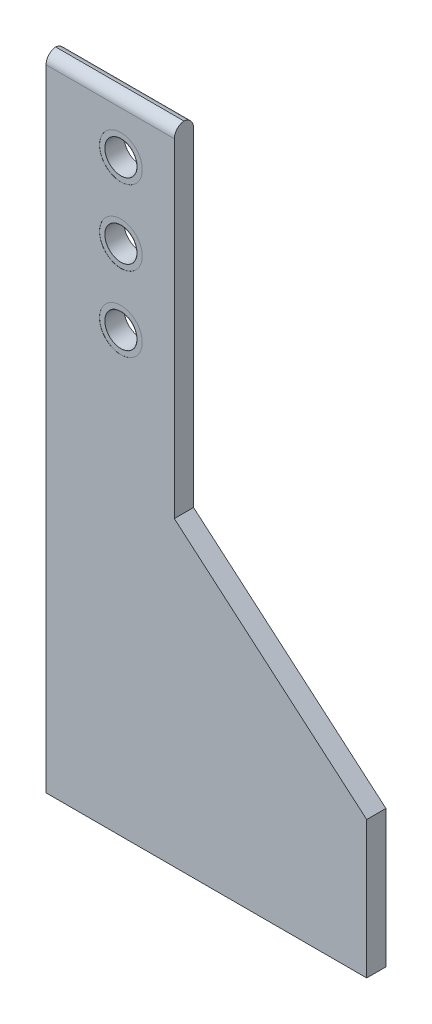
ISO-10303-21;
HEADER;
FILE_DESCRIPTION(('STEP AP214'),'2;1');
FILE_NAME('part.step','',(''),(''),'','','');
FILE_SCHEMA(('AUTOMOTIVE_DESIGN { 1 0 10303 214 1 1 1 1 }'));
ENDSEC;
DATA;
#1=APPLICATION_CONTEXT('core data for automotive mechanical design processes');
#2=APPLICATION_PROTOCOL_DEFINITION('international standard','automotive_design',2000,#1);
#3=PRODUCT_CONTEXT('',#1,'mechanical');
#4=PRODUCT('Part','Part','',(#3));
#5=PRODUCT_RELATED_PRODUCT_CATEGORY('part','',(#4));
#6=PRODUCT_DEFINITION_FORMATION('','',#4);
#7=PRODUCT_DEFINITION_CONTEXT('part definition',#1,'design');
#8=PRODUCT_DEFINITION('design','',#6,#7);
#9=PRODUCT_DEFINITION_SHAPE('','',#8);
#10=(LENGTH_UNIT() NAMED_UNIT(*) SI_UNIT(.MILLI.,.METRE.));
#11=(NAMED_UNIT(*) PLANE_ANGLE_UNIT() SI_UNIT($,.RADIAN.));
#12=(NAMED_UNIT(*) SI_UNIT($,.STERADIAN.) SOLID_ANGLE_UNIT());
#13=UNCERTAINTY_MEASURE_WITH_UNIT(LENGTH_MEASURE(1.E-05),#10,'distance_accuracy_value','');
#14=(GEOMETRIC_REPRESENTATION_CONTEXT(3) GLOBAL_UNCERTAINTY_ASSIGNED_CONTEXT((#13)) GLOBAL_UNIT_ASSIGNED_CONTEXT((#10,
#11,#12)) REPRESENTATION_CONTEXT('',''));
#15=CARTESIAN_POINT('',(0.,0.,0.));
#16=DIRECTION('',(0.,0.,1.));
#17=DIRECTION('',(1.,0.,0.));
#18=AXIS2_PLACEMENT_3D('',#15,#16,#17);
#19=CARTESIAN_POINT('',(0.,0.,0.));
#20=DIRECTION('',(0.,0.,1.));
#21=DIRECTION('',(1.,0.,0.));
#22=AXIS2_PLACEMENT_3D('',#19,#20,#21);
#23=PLANE('',#22);
#24=DIRECTION('',(0.,-1.,0.));
#25=VECTOR('',#24,1.);
#26=CARTESIAN_POINT('',(-150.,300.,0.));
#27=LINE('',#26,#25);
#28=CARTESIAN_POINT('',(-150.,290.,0.));
#29=VERTEX_POINT('',#28);
#30=CARTESIAN_POINT('',(-150.,-300.,0.));
#31=VERTEX_POINT('',#30);
#32=EDGE_CURVE('E139',#29,#31,#27,.T.);
#33=ORIENTED_EDGE('',*,*,#32,.F.);
#34=DIRECTION('',(-1.,0.,0.));
#35=VECTOR('',#34,1.);
#36=CARTESIAN_POINT('',(0.,290.,0.));
#37=LINE('',#36,#35);
#38=CARTESIAN_POINT('',(-30.,290.,0.));
#39=VERTEX_POINT('',#38);
#40=EDGE_CURVE('E154',#29,#39,#37,.F.);
#41=ORIENTED_EDGE('',*,*,#40,.T.);
#42=DIRECTION('',(0.,-1.,0.));
#43=VECTOR('',#42,1.);
#44=CARTESIAN_POINT('',(-30.,0.,0.));
#45=LINE('',#44,#43);
#46=CARTESIAN_POINT('',(-30.,-17.7530546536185,0.));
#47=VERTEX_POINT('',#46);
#48=EDGE_CURVE('E148',#39,#47,#45,.T.);
#49=ORIENTED_EDGE('',*,*,#48,.T.);
#50=DIRECTION('',(0.760181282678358,-0.649711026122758,0.));
#51=VECTOR('',#50,1.);
#52=CARTESIAN_POINT('',(-21.4319335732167,-25.076001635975,0.));
#53=LINE('',#52,#51);
#54=CARTESIAN_POINT('',(150.,-171.595285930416,0.));
#55=VERTEX_POINT('',#54);
#56=EDGE_CURVE('E100',#47,#55,#53,.T.);
#57=ORIENTED_EDGE('',*,*,#56,.T.);
#58=DIRECTION('',(0.,1.,0.));
#59=VECTOR('',#58,1.);
#60=CARTESIAN_POINT('',(150.,300.,0.));
#61=LINE('',#60,#59);
#62=CARTESIAN_POINT('',(150.,-300.,0.));
#63=VERTEX_POINT('',#62);
#64=EDGE_CURVE('E127',#63,#55,#61,.T.);
#65=ORIENTED_EDGE('',*,*,#64,.F.);
#66=DIRECTION('',(1.,0.,0.));
#67=VECTOR('',#66,1.);
#68=CARTESIAN_POINT('',(-150.,-300.,0.));
#69=LINE('',#68,#67);
#70=EDGE_CURVE('E132',#31,#63,#69,.T.);
#71=ORIENTED_EDGE('',*,*,#70,.F.);
#72=EDGE_LOOP('',(#33,#41,#49,#57,#65,#71));
#73=FACE_BOUND('',#72,.T.);
#74=CARTESIAN_POINT('',(-80.,250.,0.));
#75=DIRECTION('',(0.,0.,1.));
#76=DIRECTION('',(1.,0.,0.));
#77=AXIS2_PLACEMENT_3D('',#74,#75,#76);
#78=CIRCLE('',#77,20.);
#79=CARTESIAN_POINT('',(-60.,250.,0.));
#80=VERTEX_POINT('',#79);
#81=EDGE_CURVE('E209',#80,#80,#78,.T.);
#82=ORIENTED_EDGE('',*,*,#81,.T.);
#83=EDGE_LOOP('',(#82));
#84=FACE_BOUND('',#83,.T.);
#85=CARTESIAN_POINT('',(-80.,180.,0.));
#86=DIRECTION('',(0.,0.,1.));
#87=DIRECTION('',(1.,0.,0.));
#88=AXIS2_PLACEMENT_3D('',#85,#86,#87);
#89=CIRCLE('',#88,20.);
#90=CARTESIAN_POINT('',(-60.,180.,0.));
#91=VERTEX_POINT('',#90);
#92=EDGE_CURVE('E221',#91,#91,#89,.T.);
#93=ORIENTED_EDGE('',*,*,#92,.T.);
#94=EDGE_LOOP('',(#93));
#95=FACE_BOUND('',#94,.T.);
#96=CARTESIAN_POINT('',(-80.,110.,0.));
#97=DIRECTION('',(0.,0.,1.));
#98=DIRECTION('',(1.,0.,0.));
#99=AXIS2_PLACEMENT_3D('',#96,#97,#98);
#100=CIRCLE('',#99,20.);
#101=CARTESIAN_POINT('',(-60.,110.,0.));
#102=VERTEX_POINT('',#101);
#103=EDGE_CURVE('E233',#102,#102,#100,.T.);
#104=ORIENTED_EDGE('',*,*,#103,.T.);
#105=EDGE_LOOP('',(#104));
#106=FACE_BOUND('',#105,.T.);
#107=ADVANCED_FACE('F32',(#73,#84,#95,#106),#23,.F.);
#108=CARTESIAN_POINT('',(-80.,110.,0.));
#109=DIRECTION('',(0.,0.,1.));
#110=DIRECTION('',(1.,0.,0.));
#111=AXIS2_PLACEMENT_3D('',#108,#109,#110);
#112=CIRCLE('',#111,15.1);
#113=CARTESIAN_POINT('',(-64.9,110.,0.));
#114=VERTEX_POINT('',#113);
#115=EDGE_CURVE('E239',#114,#114,#112,.T.);
#116=ORIENTED_EDGE('',*,*,#115,.F.);
#117=EDGE_LOOP('',(#116));
#118=FACE_BOUND('',#117,.T.);
#119=CARTESIAN_POINT('',(-80.,110.,0.));
#120=DIRECTION('',(0.,0.,1.));
#121=DIRECTION('',(1.,0.,0.));
#122=AXIS2_PLACEMENT_3D('',#119,#120,#121);
#123=CIRCLE('',#122,15.);
#124=CARTESIAN_POINT('',(-65.,110.,0.));
#125=VERTEX_POINT('',#124);
#126=EDGE_CURVE('E112',#125,#125,#123,.T.);
#127=ORIENTED_EDGE('',*,*,#126,.T.);
#128=EDGE_LOOP('',(#127));
#129=FACE_BOUND('',#128,.T.);
#130=ADVANCED_FACE('F254',(#118,#129),#23,.F.);
#131=CARTESIAN_POINT('',(-80.,180.,0.));
#132=DIRECTION('',(0.,0.,1.));
#133=DIRECTION('',(1.,0.,0.));
#134=AXIS2_PLACEMENT_3D('',#131,#132,#133);
#135=CIRCLE('',#134,15.1);
#136=CARTESIAN_POINT('',(-64.9,180.,0.));
#137=VERTEX_POINT('',#136);
#138=EDGE_CURVE('E227',#137,#137,#135,.T.);
#139=ORIENTED_EDGE('',*,*,#138,.F.);
#140=EDGE_LOOP('',(#139));
#141=FACE_BOUND('',#140,.T.);
#142=CARTESIAN_POINT('',(-80.,180.,0.));
#143=DIRECTION('',(0.,0.,1.));
#144=DIRECTION('',(1.,0.,0.));
#145=AXIS2_PLACEMENT_3D('',#142,#143,#144);
#146=CIRCLE('',#145,15.);
#147=CARTESIAN_POINT('',(-65.,180.,0.));
#148=VERTEX_POINT('',#147);
#149=EDGE_CURVE('E118',#148,#148,#146,.T.);
#150=ORIENTED_EDGE('',*,*,#149,.T.);
#151=EDGE_LOOP('',(#150));
#152=FACE_BOUND('',#151,.T.);
#153=ADVANCED_FACE('F257',(#141,#152),#23,.F.);
#154=CARTESIAN_POINT('',(0.,0.,18.));
#155=DIRECTION('',(0.,0.,1.));
#156=DIRECTION('',(1.,0.,0.));
#157=AXIS2_PLACEMENT_3D('',#154,#155,#156);
#158=PLANE('',#157);
#159=CARTESIAN_POINT('',(-80.,110.,18.));
#160=DIRECTION('',(0.,0.,1.));
#161=DIRECTION('',(1.,0.,0.));
#162=AXIS2_PLACEMENT_3D('',#159,#160,#161);
#163=CIRCLE('',#162,15.);
#164=CARTESIAN_POINT('',(-65.,110.,18.));
#165=VERTEX_POINT('',#164);
#166=EDGE_CURVE('E110',#165,#165,#163,.T.);
#167=ORIENTED_EDGE('',*,*,#166,.F.);
#168=EDGE_LOOP('',(#167));
#169=FACE_BOUND('',#168,.T.);
#170=CARTESIAN_POINT('',(-80.,110.,18.));
#171=DIRECTION('',(0.,0.,1.));
#172=DIRECTION('',(1.,0.,0.));
#173=AXIS2_PLACEMENT_3D('',#170,#171,#172);
#174=CIRCLE('',#173,15.1);
#175=CARTESIAN_POINT('',(-64.9,110.,18.));
#176=VERTEX_POINT('',#175);
#177=EDGE_CURVE('E203',#176,#176,#174,.T.);
#178=ORIENTED_EDGE('',*,*,#177,.T.);
#179=EDGE_LOOP('',(#178));
#180=FACE_BOUND('',#179,.T.);
#181=ADVANCED_FACE('F268',(#169,#180),#158,.T.);
#182=CARTESIAN_POINT('',(-80.,180.,18.));
#183=DIRECTION('',(0.,0.,1.));
#184=DIRECTION('',(1.,0.,0.));
#185=AXIS2_PLACEMENT_3D('',#182,#183,#184);
#186=CIRCLE('',#185,15.);
#187=CARTESIAN_POINT('',(-65.,180.,18.));
#188=VERTEX_POINT('',#187);
#189=EDGE_CURVE('E115',#188,#188,#186,.T.);
#190=ORIENTED_EDGE('',*,*,#189,.F.);
#191=EDGE_LOOP('',(#190));
#192=FACE_BOUND('',#191,.T.);
#193=CARTESIAN_POINT('',(-80.,180.,18.));
#194=DIRECTION('',(0.,0.,1.));
#195=DIRECTION('',(1.,0.,0.));
#196=AXIS2_PLACEMENT_3D('',#193,#194,#195);
#197=CIRCLE('',#196,15.1);
#198=CARTESIAN_POINT('',(-64.9,180.,18.));
#199=VERTEX_POINT('',#198);
#200=EDGE_CURVE('E191',#199,#199,#197,.T.);
#201=ORIENTED_EDGE('',*,*,#200,.T.);
#202=EDGE_LOOP('',(#201));
#203=FACE_BOUND('',#202,.T.);
#204=ADVANCED_FACE('F271',(#192,#203),#158,.T.);
#205=CARTESIAN_POINT('',(-80.,250.,18.));
#206=DIRECTION('',(0.,0.,1.));
#207=DIRECTION('',(1.,0.,0.));
#208=AXIS2_PLACEMENT_3D('',#205,#206,#207);
#209=CIRCLE('',#208,15.);
#210=CARTESIAN_POINT('',(-65.,250.,18.));
#211=VERTEX_POINT('',#210);
#212=EDGE_CURVE('E121',#211,#211,#209,.T.);
#213=ORIENTED_EDGE('',*,*,#212,.F.);
#214=EDGE_LOOP('',(#213));
#215=FACE_BOUND('',#214,.T.);
#216=CARTESIAN_POINT('',(-80.,250.,18.));
#217=DIRECTION('',(0.,0.,1.));
#218=DIRECTION('',(1.,0.,0.));
#219=AXIS2_PLACEMENT_3D('',#216,#217,#218);
#220=CIRCLE('',#219,15.1);
#221=CARTESIAN_POINT('',(-64.9,250.,18.));
#222=VERTEX_POINT('',#221);
#223=EDGE_CURVE('E179',#222,#222,#220,.T.);
#224=ORIENTED_EDGE('',*,*,#223,.T.);
#225=EDGE_LOOP('',(#224));
#226=FACE_BOUND('',#225,.T.);
#227=ADVANCED_FACE('F308',(#215,#226),#158,.T.);
#228=CARTESIAN_POINT('',(150.,300.,18.));
#229=DIRECTION('',(-1.,0.,0.));
#230=DIRECTION('',(0.,0.,1.));
#231=AXIS2_PLACEMENT_3D('',#228,#229,#230);
#232=PLANE('',#231);
#233=ORIENTED_EDGE('',*,*,#64,.T.);
#234=DIRECTION('',(0.,0.,1.));
#235=VECTOR('',#234,1.);
#236=CARTESIAN_POINT('',(150.,-171.595285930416,-42.));
#237=LINE('',#236,#235);
#238=CARTESIAN_POINT('',(150.,-171.595285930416,18.));
#239=VERTEX_POINT('',#238);
#240=EDGE_CURVE('E101',#55,#239,#237,.T.);
#241=ORIENTED_EDGE('',*,*,#240,.T.);
#242=DIRECTION('',(0.,1.,0.));
#243=VECTOR('',#242,1.);
#244=CARTESIAN_POINT('',(150.,300.,18.));
#245=LINE('',#244,#243);
#246=CARTESIAN_POINT('',(150.,-300.,18.));
#247=VERTEX_POINT('',#246);
#248=EDGE_CURVE('E106',#247,#239,#245,.T.);
#249=ORIENTED_EDGE('',*,*,#248,.F.);
#250=DIRECTION('',(0.,0.,-1.));
#251=VECTOR('',#250,1.);
#252=CARTESIAN_POINT('',(150.,-300.,18.));
#253=LINE('',#252,#251);
#254=EDGE_CURVE('E136',#247,#63,#253,.T.);
#255=ORIENTED_EDGE('',*,*,#254,.T.);
#256=EDGE_LOOP('',(#233,#241,#249,#255));
#257=FACE_BOUND('',#256,.T.);
#258=ADVANCED_FACE('F573',(#257),#232,.F.);
#259=CARTESIAN_POINT('',(-150.,300.,18.));
#260=DIRECTION('',(1.,0.,0.));
#261=DIRECTION('',(0.,1.,0.));
#262=AXIS2_PLACEMENT_3D('',#259,#260,#261);
#263=PLANE('',#262);
#264=CARTESIAN_POINT('',(-150.,290.,8.));
#265=DIRECTION('',(1.,0.,0.));
#266=DIRECTION('',(0.,1.,0.));
#267=AXIS2_PLACEMENT_3D('',#264,#265,#266);
#268=CIRCLE('',#267,10.);
#269=CARTESIAN_POINT('',(-150.,290.,18.));
#270=VERTEX_POINT('',#269);
#271=CARTESIAN_POINT('',(-150.,299.949874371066,9.));
#272=VERTEX_POINT('',#271);
#273=EDGE_CURVE('E150',#270,#272,#268,.F.);
#274=ORIENTED_EDGE('',*,*,#273,.T.);
#275=CARTESIAN_POINT('',(-150.,290.,10.));
#276=DIRECTION('',(1.,0.,0.));
#277=DIRECTION('',(0.,1.,0.));
#278=AXIS2_PLACEMENT_3D('',#275,#276,#277);
#279=CIRCLE('',#278,10.);
#280=EDGE_CURVE('E152',#272,#29,#279,.F.);
#281=ORIENTED_EDGE('',*,*,#280,.T.);
#282=ORIENTED_EDGE('',*,*,#32,.T.);
#283=DIRECTION('',(0.,0.,-1.));
#284=VECTOR('',#283,1.);
#285=CARTESIAN_POINT('',(-150.,-300.,18.));
#286=LINE('',#285,#284);
#287=CARTESIAN_POINT('',(-150.,-300.,18.));
#288=VERTEX_POINT('',#287);
#289=EDGE_CURVE('E144',#288,#31,#286,.T.);
#290=ORIENTED_EDGE('',*,*,#289,.F.);
#291=DIRECTION('',(0.,-1.,0.));
#292=VECTOR('',#291,1.);
#293=CARTESIAN_POINT('',(-150.,300.,18.));
#294=LINE('',#293,#292);
#295=EDGE_CURVE('E131',#270,#288,#294,.T.);
#296=ORIENTED_EDGE('',*,*,#295,.F.);
#297=EDGE_LOOP('',(#274,#281,#282,#290,#296));
#298=FACE_BOUND('',#297,.T.);
#299=ADVANCED_FACE('F598',(#298),#263,.F.);
#300=CARTESIAN_POINT('',(-150.,-300.,18.));
#301=DIRECTION('',(0.,1.,0.));
#302=DIRECTION('',(0.,0.,1.));
#303=AXIS2_PLACEMENT_3D('',#300,#301,#302);
#304=PLANE('',#303);
#305=ORIENTED_EDGE('',*,*,#70,.T.);
#306=ORIENTED_EDGE('',*,*,#254,.F.);
#307=DIRECTION('',(1.,0.,0.));
#308=VECTOR('',#307,1.);
#309=CARTESIAN_POINT('',(-150.,-300.,18.));
#310=LINE('',#309,#308);
#311=EDGE_CURVE('E134',#288,#247,#310,.T.);
#312=ORIENTED_EDGE('',*,*,#311,.F.);
#313=ORIENTED_EDGE('',*,*,#289,.T.);
#314=EDGE_LOOP('',(#305,#306,#312,#313));
#315=FACE_BOUND('',#314,.T.);
#316=ADVANCED_FACE('F306',(#315),#304,.F.);
#317=CARTESIAN_POINT('',(-80.,110.,18.));
#318=DIRECTION('',(0.,0.,1.));
#319=DIRECTION('',(1.,0.,0.));
#320=AXIS2_PLACEMENT_3D('',#317,#318,#319);
#321=CIRCLE('',#320,20.);
#322=CARTESIAN_POINT('',(-60.,110.,18.));
#323=VERTEX_POINT('',#322);
#324=EDGE_CURVE('E197',#323,#323,#321,.T.);
#325=ORIENTED_EDGE('',*,*,#324,.F.);
#326=EDGE_LOOP('',(#325));
#327=FACE_BOUND('',#326,.T.);
#328=CARTESIAN_POINT('',(-80.,180.,18.));
#329=DIRECTION('',(0.,0.,1.));
#330=DIRECTION('',(1.,0.,0.));
#331=AXIS2_PLACEMENT_3D('',#328,#329,#330);
#332=CIRCLE('',#331,20.);
#333=CARTESIAN_POINT('',(-60.,180.,18.));
#334=VERTEX_POINT('',#333);
#335=EDGE_CURVE('E185',#334,#334,#332,.T.);
#336=ORIENTED_EDGE('',*,*,#335,.F.);
#337=EDGE_LOOP('',(#336));
#338=FACE_BOUND('',#337,.T.);
#339=CARTESIAN_POINT('',(-80.,250.,18.));
#340=DIRECTION('',(0.,0.,1.));
#341=DIRECTION('',(1.,0.,0.));
#342=AXIS2_PLACEMENT_3D('',#339,#340,#341);
#343=CIRCLE('',#342,20.);
#344=CARTESIAN_POINT('',(-60.,250.,18.));
#345=VERTEX_POINT('',#344);
#346=EDGE_CURVE('E172',#345,#345,#343,.T.);
#347=ORIENTED_EDGE('',*,*,#346,.F.);
#348=EDGE_LOOP('',(#347));
#349=FACE_BOUND('',#348,.T.);
#350=DIRECTION('',(0.,-1.,0.));
#351=VECTOR('',#350,1.);
#352=CARTESIAN_POINT('',(-30.,300.,18.));
#353=LINE('',#352,#351);
#354=CARTESIAN_POINT('',(-30.,290.,18.));
#355=VERTEX_POINT('',#354);
#356=CARTESIAN_POINT('',(-30.,-17.7530546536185,18.));
#357=VERTEX_POINT('',#356);
#358=EDGE_CURVE('E86',#355,#357,#353,.T.);
#359=ORIENTED_EDGE('',*,*,#358,.F.);
#360=DIRECTION('',(-1.,0.,0.));
#361=VECTOR('',#360,1.);
#362=CARTESIAN_POINT('',(-150.,290.,18.));
#363=LINE('',#362,#361);
#364=EDGE_CURVE('E11',#355,#270,#363,.T.);
#365=ORIENTED_EDGE('',*,*,#364,.T.);
#366=ORIENTED_EDGE('',*,*,#295,.T.);
#367=ORIENTED_EDGE('',*,*,#311,.T.);
#368=ORIENTED_EDGE('',*,*,#248,.T.);
#369=DIRECTION('',(0.760181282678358,-0.649711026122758,0.));
#370=VECTOR('',#369,1.);
#371=CARTESIAN_POINT('',(-30.,-17.7530546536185,18.));
#372=LINE('',#371,#370);
#373=EDGE_CURVE('E93',#357,#239,#372,.T.);
#374=ORIENTED_EDGE('',*,*,#373,.F.);
#375=EDGE_LOOP('',(#359,#365,#366,#367,#368,#374));
#376=FACE_BOUND('',#375,.T.);
#377=ADVANCED_FACE('F104',(#327,#338,#349,#376),#158,.T.);
#378=CARTESIAN_POINT('',(-80.,250.,0.));
#379=DIRECTION('',(0.,0.,1.));
#380=DIRECTION('',(1.,0.,0.));
#381=AXIS2_PLACEMENT_3D('',#378,#379,#380);
#382=CIRCLE('',#381,15.1);
#383=CARTESIAN_POINT('',(-64.9,250.,0.));
#384=VERTEX_POINT('',#383);
#385=EDGE_CURVE('E215',#384,#384,#382,.T.);
#386=ORIENTED_EDGE('',*,*,#385,.F.);
#387=EDGE_LOOP('',(#386));
#388=FACE_BOUND('',#387,.T.);
#389=CARTESIAN_POINT('',(-80.,250.,0.));
#390=DIRECTION('',(0.,0.,1.));
#391=DIRECTION('',(1.,0.,0.));
#392=AXIS2_PLACEMENT_3D('',#389,#390,#391);
#393=CIRCLE('',#392,15.);
#394=CARTESIAN_POINT('',(-65.,250.,0.));
#395=VERTEX_POINT('',#394);
#396=EDGE_CURVE('E124',#395,#395,#393,.T.);
#397=ORIENTED_EDGE('',*,*,#396,.T.);
#398=EDGE_LOOP('',(#397));
#399=FACE_BOUND('',#398,.T.);
#400=ADVANCED_FACE('F293',(#388,#399),#23,.F.);
#401=CARTESIAN_POINT('',(-80.,250.,0.));
#402=DIRECTION('',(0.,0.,1.));
#403=DIRECTION('',(1.,0.,0.));
#404=AXIS2_PLACEMENT_3D('',#401,#402,#403);
#405=CYLINDRICAL_SURFACE('',#404,15.);
#406=ORIENTED_EDGE('',*,*,#396,.F.);
#407=EDGE_LOOP('',(#406));
#408=FACE_BOUND('',#407,.T.);
#409=ORIENTED_EDGE('',*,*,#212,.T.);
#410=EDGE_LOOP('',(#409));
#411=FACE_BOUND('',#410,.T.);
#412=ADVANCED_FACE('F298',(#408,#411),#405,.F.);
#413=CARTESIAN_POINT('',(-80.,180.,0.));
#414=DIRECTION('',(0.,0.,1.));
#415=DIRECTION('',(1.,0.,0.));
#416=AXIS2_PLACEMENT_3D('',#413,#414,#415);
#417=CYLINDRICAL_SURFACE('',#416,15.);
#418=ORIENTED_EDGE('',*,*,#149,.F.);
#419=EDGE_LOOP('',(#418));
#420=FACE_BOUND('',#419,.T.);
#421=ORIENTED_EDGE('',*,*,#189,.T.);
#422=EDGE_LOOP('',(#421));
#423=FACE_BOUND('',#422,.T.);
#424=ADVANCED_FACE('F264',(#420,#423),#417,.F.);
#425=CARTESIAN_POINT('',(-80.,110.,0.));
#426=DIRECTION('',(0.,0.,1.));
#427=DIRECTION('',(1.,0.,0.));
#428=AXIS2_PLACEMENT_3D('',#425,#426,#427);
#429=CYLINDRICAL_SURFACE('',#428,15.);
#430=ORIENTED_EDGE('',*,*,#126,.F.);
#431=EDGE_LOOP('',(#430));
#432=FACE_BOUND('',#431,.T.);
#433=ORIENTED_EDGE('',*,*,#166,.T.);
#434=EDGE_LOOP('',(#433));
#435=FACE_BOUND('',#434,.T.);
#436=ADVANCED_FACE('F261',(#432,#435),#429,.F.);
#437=CARTESIAN_POINT('',(-30.,300.,-42.));
#438=DIRECTION('',(-1.,0.,0.));
#439=DIRECTION('',(0.,-1.,0.));
#440=AXIS2_PLACEMENT_3D('',#437,#438,#439);
#441=PLANE('',#440);
#442=ORIENTED_EDGE('',*,*,#48,.F.);
#443=CARTESIAN_POINT('',(-30.,290.,10.));
#444=DIRECTION('',(-1.,0.,0.));
#445=DIRECTION('',(0.,-1.,0.));
#446=AXIS2_PLACEMENT_3D('',#443,#444,#445);
#447=CIRCLE('',#446,10.);
#448=CARTESIAN_POINT('',(-30.,299.949874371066,9.));
#449=VERTEX_POINT('',#448);
#450=EDGE_CURVE('E41',#39,#449,#447,.F.);
#451=ORIENTED_EDGE('',*,*,#450,.T.);
#452=CARTESIAN_POINT('',(-30.,290.,8.));
#453=DIRECTION('',(-1.,0.,0.));
#454=DIRECTION('',(0.,-1.,0.));
#455=AXIS2_PLACEMENT_3D('',#452,#453,#454);
#456=CIRCLE('',#455,10.);
#457=EDGE_CURVE('E51',#449,#355,#456,.F.);
#458=ORIENTED_EDGE('',*,*,#457,.T.);
#459=ORIENTED_EDGE('',*,*,#358,.T.);
#460=DIRECTION('',(0.,0.,1.));
#461=VECTOR('',#460,1.);
#462=CARTESIAN_POINT('',(-30.,-17.7530546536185,-42.));
#463=LINE('',#462,#461);
#464=EDGE_CURVE('E89',#47,#357,#463,.T.);
#465=ORIENTED_EDGE('',*,*,#464,.F.);
#466=EDGE_LOOP('',(#442,#451,#458,#459,#465));
#467=FACE_BOUND('',#466,.T.);
#468=ADVANCED_FACE('F88',(#467),#441,.F.);
#469=CARTESIAN_POINT('',(-30.,-17.7530546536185,-42.));
#470=DIRECTION('',(-0.649711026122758,-0.760181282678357,0.));
#471=DIRECTION('',(0.760181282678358,-0.649711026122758,0.));
#472=AXIS2_PLACEMENT_3D('',#469,#470,#471);
#473=PLANE('',#472);
#474=ORIENTED_EDGE('',*,*,#464,.T.);
#475=ORIENTED_EDGE('',*,*,#373,.T.);
#476=ORIENTED_EDGE('',*,*,#240,.F.);
#477=ORIENTED_EDGE('',*,*,#56,.F.);
#478=EDGE_LOOP('',(#474,#475,#476,#477));
#479=FACE_BOUND('',#478,.T.);
#480=ADVANCED_FACE('F97',(#479),#473,.F.);
#481=CARTESIAN_POINT('',(0.,290.,8.));
#482=DIRECTION('',(1.,0.,0.));
#483=DIRECTION('',(0.,0.,-1.));
#484=AXIS2_PLACEMENT_3D('',#481,#482,#483);
#485=CYLINDRICAL_SURFACE('',#484,10.);
#486=ORIENTED_EDGE('',*,*,#364,.F.);
#487=ORIENTED_EDGE('',*,*,#457,.F.);
#488=DIRECTION('',(1.,0.,0.));
#489=VECTOR('',#488,1.);
#490=CARTESIAN_POINT('',(-90.,299.949874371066,9.));
#491=LINE('',#490,#489);
#492=EDGE_CURVE('E36',#272,#449,#491,.T.);
#493=ORIENTED_EDGE('',*,*,#492,.F.);
#494=ORIENTED_EDGE('',*,*,#273,.F.);
#495=EDGE_LOOP('',(#486,#487,#493,#494));
#496=FACE_BOUND('',#495,.T.);
#497=ADVANCED_FACE('F34',(#496),#485,.T.);
#498=CARTESIAN_POINT('',(-150.,290.,10.));
#499=DIRECTION('',(-1.,0.,0.));
#500=DIRECTION('',(0.,0.,1.));
#501=AXIS2_PLACEMENT_3D('',#498,#499,#500);
#502=CYLINDRICAL_SURFACE('',#501,10.);
#503=ORIENTED_EDGE('',*,*,#450,.F.);
#504=ORIENTED_EDGE('',*,*,#40,.F.);
#505=ORIENTED_EDGE('',*,*,#280,.F.);
#506=ORIENTED_EDGE('',*,*,#492,.T.);
#507=EDGE_LOOP('',(#503,#504,#505,#506));
#508=FACE_BOUND('',#507,.T.);
#509=ADVANCED_FACE('F165',(#508),#502,.T.);
#510=CARTESIAN_POINT('',(-80.,250.,17.9));
#511=DIRECTION('',(0.,0.,1.));
#512=DIRECTION('',(1.,0.,0.));
#513=AXIS2_PLACEMENT_3D('',#510,#511,#512);
#514=CYLINDRICAL_SURFACE('',#513,20.);
#515=CARTESIAN_POINT('',(-80.,250.,17.9));
#516=DIRECTION('',(0.,0.,1.));
#517=DIRECTION('',(1.,0.,0.));
#518=AXIS2_PLACEMENT_3D('',#515,#516,#517);
#519=CIRCLE('',#518,20.);
#520=CARTESIAN_POINT('',(-60.,250.,17.9));
#521=VERTEX_POINT('',#520);
#522=EDGE_CURVE('E170',#521,#521,#519,.T.);
#523=ORIENTED_EDGE('',*,*,#522,.F.);
#524=EDGE_LOOP('',(#523));
#525=FACE_BOUND('',#524,.T.);
#526=ORIENTED_EDGE('',*,*,#346,.T.);
#527=EDGE_LOOP('',(#526));
#528=FACE_BOUND('',#527,.T.);
#529=ADVANCED_FACE('F353',(#525,#528),#514,.F.);
#530=CARTESIAN_POINT('',(-80.,250.,17.9));
#531=DIRECTION('',(0.,0.,1.));
#532=DIRECTION('',(1.,0.,0.));
#533=AXIS2_PLACEMENT_3D('',#530,#531,#532);
#534=PLANE('',#533);
#535=CARTESIAN_POINT('',(-80.,250.,17.9));
#536=DIRECTION('',(0.,0.,1.));
#537=DIRECTION('',(1.,0.,0.));
#538=AXIS2_PLACEMENT_3D('',#535,#536,#537);
#539=CIRCLE('',#538,15.1);
#540=CARTESIAN_POINT('',(-64.9,250.,17.9));
#541=VERTEX_POINT('',#540);
#542=EDGE_CURVE('E177',#541,#541,#539,.T.);
#543=ORIENTED_EDGE('',*,*,#542,.F.);
#544=EDGE_LOOP('',(#543));
#545=FACE_BOUND('',#544,.T.);
#546=ORIENTED_EDGE('',*,*,#522,.T.);
#547=EDGE_LOOP('',(#546));
#548=FACE_BOUND('',#547,.T.);
#549=ADVANCED_FACE('F349',(#545,#548),#534,.T.);
#550=CARTESIAN_POINT('',(-80.,250.,17.9));
#551=DIRECTION('',(0.,0.,1.));
#552=DIRECTION('',(1.,0.,0.));
#553=AXIS2_PLACEMENT_3D('',#550,#551,#552);
#554=CYLINDRICAL_SURFACE('',#553,15.1);
#555=ORIENTED_EDGE('',*,*,#542,.T.);
#556=EDGE_LOOP('',(#555));
#557=FACE_BOUND('',#556,.T.);
#558=ORIENTED_EDGE('',*,*,#223,.F.);
#559=EDGE_LOOP('',(#558));
#560=FACE_BOUND('',#559,.T.);
#561=ADVANCED_FACE('F345',(#557,#560),#554,.T.);
#562=CARTESIAN_POINT('',(-80.,180.,17.9));
#563=DIRECTION('',(0.,0.,1.));
#564=DIRECTION('',(1.,0.,0.));
#565=AXIS2_PLACEMENT_3D('',#562,#563,#564);
#566=CYLINDRICAL_SURFACE('',#565,20.);
#567=CARTESIAN_POINT('',(-80.,180.,17.9));
#568=DIRECTION('',(0.,0.,1.));
#569=DIRECTION('',(1.,0.,0.));
#570=AXIS2_PLACEMENT_3D('',#567,#568,#569);
#571=CIRCLE('',#570,20.);
#572=CARTESIAN_POINT('',(-60.,180.,17.9));
#573=VERTEX_POINT('',#572);
#574=EDGE_CURVE('E182',#573,#573,#571,.T.);
#575=ORIENTED_EDGE('',*,*,#574,.F.);
#576=EDGE_LOOP('',(#575));
#577=FACE_BOUND('',#576,.T.);
#578=ORIENTED_EDGE('',*,*,#335,.T.);
#579=EDGE_LOOP('',(#578));
#580=FACE_BOUND('',#579,.T.);
#581=ADVANCED_FACE('F339',(#577,#580),#566,.F.);
#582=CARTESIAN_POINT('',(-80.,180.,17.9));
#583=DIRECTION('',(0.,0.,1.));
#584=DIRECTION('',(1.,0.,0.));
#585=AXIS2_PLACEMENT_3D('',#582,#583,#584);
#586=PLANE('',#585);
#587=CARTESIAN_POINT('',(-80.,180.,17.9));
#588=DIRECTION('',(0.,0.,1.));
#589=DIRECTION('',(1.,0.,0.));
#590=AXIS2_PLACEMENT_3D('',#587,#588,#589);
#591=CIRCLE('',#590,15.1);
#592=CARTESIAN_POINT('',(-64.9,180.,17.9));
#593=VERTEX_POINT('',#592);
#594=EDGE_CURVE('E188',#593,#593,#591,.T.);
#595=ORIENTED_EDGE('',*,*,#594,.F.);
#596=EDGE_LOOP('',(#595));
#597=FACE_BOUND('',#596,.T.);
#598=ORIENTED_EDGE('',*,*,#574,.T.);
#599=EDGE_LOOP('',(#598));
#600=FACE_BOUND('',#599,.T.);
#601=ADVANCED_FACE('F330',(#597,#600),#586,.T.);
#602=CARTESIAN_POINT('',(-80.,180.,17.9));
#603=DIRECTION('',(0.,0.,1.));
#604=DIRECTION('',(1.,0.,0.));
#605=AXIS2_PLACEMENT_3D('',#602,#603,#604);
#606=CYLINDRICAL_SURFACE('',#605,15.1);
#607=ORIENTED_EDGE('',*,*,#594,.T.);
#608=EDGE_LOOP('',(#607));
#609=FACE_BOUND('',#608,.T.);
#610=ORIENTED_EDGE('',*,*,#200,.F.);
#611=EDGE_LOOP('',(#610));
#612=FACE_BOUND('',#611,.T.);
#613=ADVANCED_FACE('F328',(#609,#612),#606,.T.);
#614=CARTESIAN_POINT('',(-80.,110.,17.9));
#615=DIRECTION('',(0.,0.,1.));
#616=DIRECTION('',(1.,0.,0.));
#617=AXIS2_PLACEMENT_3D('',#614,#615,#616);
#618=CYLINDRICAL_SURFACE('',#617,20.);
#619=CARTESIAN_POINT('',(-80.,110.,17.9));
#620=DIRECTION('',(0.,0.,1.));
#621=DIRECTION('',(1.,0.,0.));
#622=AXIS2_PLACEMENT_3D('',#619,#620,#621);
#623=CIRCLE('',#622,20.);
#624=CARTESIAN_POINT('',(-60.,110.,17.9));
#625=VERTEX_POINT('',#624);
#626=EDGE_CURVE('E194',#625,#625,#623,.T.);
#627=ORIENTED_EDGE('',*,*,#626,.F.);
#628=EDGE_LOOP('',(#627));
#629=FACE_BOUND('',#628,.T.);
#630=ORIENTED_EDGE('',*,*,#324,.T.);
#631=EDGE_LOOP('',(#630));
#632=FACE_BOUND('',#631,.T.);
#633=ADVANCED_FACE('F288',(#629,#632),#618,.F.);
#634=CARTESIAN_POINT('',(-80.,110.,17.9));
#635=DIRECTION('',(0.,0.,1.));
#636=DIRECTION('',(1.,0.,0.));
#637=AXIS2_PLACEMENT_3D('',#634,#635,#636);
#638=PLANE('',#637);
#639=CARTESIAN_POINT('',(-80.,110.,17.9));
#640=DIRECTION('',(0.,0.,1.));
#641=DIRECTION('',(1.,0.,0.));
#642=AXIS2_PLACEMENT_3D('',#639,#640,#641);
#643=CIRCLE('',#642,15.1);
#644=CARTESIAN_POINT('',(-64.9,110.,17.9));
#645=VERTEX_POINT('',#644);
#646=EDGE_CURVE('E200',#645,#645,#643,.T.);
#647=ORIENTED_EDGE('',*,*,#646,.F.);
#648=EDGE_LOOP('',(#647));
#649=FACE_BOUND('',#648,.T.);
#650=ORIENTED_EDGE('',*,*,#626,.T.);
#651=EDGE_LOOP('',(#650));
#652=FACE_BOUND('',#651,.T.);
#653=ADVANCED_FACE('F278',(#649,#652),#638,.T.);
#654=CARTESIAN_POINT('',(-80.,110.,17.9));
#655=DIRECTION('',(0.,0.,1.));
#656=DIRECTION('',(1.,0.,0.));
#657=AXIS2_PLACEMENT_3D('',#654,#655,#656);
#658=CYLINDRICAL_SURFACE('',#657,15.1);
#659=ORIENTED_EDGE('',*,*,#646,.T.);
#660=EDGE_LOOP('',(#659));
#661=FACE_BOUND('',#660,.T.);
#662=ORIENTED_EDGE('',*,*,#177,.F.);
#663=EDGE_LOOP('',(#662));
#664=FACE_BOUND('',#663,.T.);
#665=ADVANCED_FACE('F275',(#661,#664),#658,.T.);
#666=CARTESIAN_POINT('',(-80.,250.,0.1));
#667=DIRECTION('',(0.,0.,-1.));
#668=DIRECTION('',(1.,0.,0.));
#669=AXIS2_PLACEMENT_3D('',#666,#667,#668);
#670=PLANE('',#669);
#671=CARTESIAN_POINT('',(-80.,250.,0.1));
#672=DIRECTION('',(0.,0.,1.));
#673=DIRECTION('',(1.,0.,0.));
#674=AXIS2_PLACEMENT_3D('',#671,#672,#673);
#675=CIRCLE('',#674,20.);
#676=CARTESIAN_POINT('',(-60.,250.,0.1));
#677=VERTEX_POINT('',#676);
#678=EDGE_CURVE('E206',#677,#677,#675,.T.);
#679=ORIENTED_EDGE('',*,*,#678,.F.);
#680=EDGE_LOOP('',(#679));
#681=FACE_BOUND('',#680,.T.);
#682=CARTESIAN_POINT('',(-80.,250.,0.1));
#683=DIRECTION('',(0.,0.,1.));
#684=DIRECTION('',(1.,0.,0.));
#685=AXIS2_PLACEMENT_3D('',#682,#683,#684);
#686=CIRCLE('',#685,15.1);
#687=CARTESIAN_POINT('',(-64.9,250.,0.1));
#688=VERTEX_POINT('',#687);
#689=EDGE_CURVE('E212',#688,#688,#686,.T.);
#690=ORIENTED_EDGE('',*,*,#689,.T.);
#691=EDGE_LOOP('',(#690));
#692=FACE_BOUND('',#691,.T.);
#693=ADVANCED_FACE('F277',(#681,#692),#670,.T.);
#694=CARTESIAN_POINT('',(-80.,250.,0.1));
#695=DIRECTION('',(0.,0.,-1.));
#696=DIRECTION('',(-1.,0.,0.));
#697=AXIS2_PLACEMENT_3D('',#694,#695,#696);
#698=CYLINDRICAL_SURFACE('',#697,20.);
#699=ORIENTED_EDGE('',*,*,#678,.T.);
#700=EDGE_LOOP('',(#699));
#701=FACE_BOUND('',#700,.T.);
#702=ORIENTED_EDGE('',*,*,#81,.F.);
#703=EDGE_LOOP('',(#702));
#704=FACE_BOUND('',#703,.T.);
#705=ADVANCED_FACE('F285',(#701,#704),#698,.F.);
#706=CARTESIAN_POINT('',(-80.,250.,0.1));
#707=DIRECTION('',(0.,0.,-1.));
#708=DIRECTION('',(-1.,0.,0.));
#709=AXIS2_PLACEMENT_3D('',#706,#707,#708);
#710=CYLINDRICAL_SURFACE('',#709,15.1);
#711=ORIENTED_EDGE('',*,*,#689,.F.);
#712=EDGE_LOOP('',(#711));
#713=FACE_BOUND('',#712,.T.);
#714=ORIENTED_EDGE('',*,*,#385,.T.);
#715=EDGE_LOOP('',(#714));
#716=FACE_BOUND('',#715,.T.);
#717=ADVANCED_FACE('F458',(#713,#716),#710,.T.);
#718=CARTESIAN_POINT('',(-80.,180.,0.1));
#719=DIRECTION('',(0.,0.,-1.));
#720=DIRECTION('',(1.,0.,0.));
#721=AXIS2_PLACEMENT_3D('',#718,#719,#720);
#722=PLANE('',#721);
#723=CARTESIAN_POINT('',(-80.,180.,0.1));
#724=DIRECTION('',(0.,0.,1.));
#725=DIRECTION('',(1.,0.,0.));
#726=AXIS2_PLACEMENT_3D('',#723,#724,#725);
#727=CIRCLE('',#726,20.);
#728=CARTESIAN_POINT('',(-60.,180.,0.1));
#729=VERTEX_POINT('',#728);
#730=EDGE_CURVE('E218',#729,#729,#727,.T.);
#731=ORIENTED_EDGE('',*,*,#730,.F.);
#732=EDGE_LOOP('',(#731));
#733=FACE_BOUND('',#732,.T.);
#734=CARTESIAN_POINT('',(-80.,180.,0.1));
#735=DIRECTION('',(0.,0.,1.));
#736=DIRECTION('',(1.,0.,0.));
#737=AXIS2_PLACEMENT_3D('',#734,#735,#736);
#738=CIRCLE('',#737,15.1);
#739=CARTESIAN_POINT('',(-64.9,180.,0.1));
#740=VERTEX_POINT('',#739);
#741=EDGE_CURVE('E224',#740,#740,#738,.T.);
#742=ORIENTED_EDGE('',*,*,#741,.T.);
#743=EDGE_LOOP('',(#742));
#744=FACE_BOUND('',#743,.T.);
#745=ADVANCED_FACE('F467',(#733,#744),#722,.T.);
#746=CARTESIAN_POINT('',(-80.,180.,0.1));
#747=DIRECTION('',(0.,0.,-1.));
#748=DIRECTION('',(-1.,0.,0.));
#749=AXIS2_PLACEMENT_3D('',#746,#747,#748);
#750=CYLINDRICAL_SURFACE('',#749,20.);
#751=ORIENTED_EDGE('',*,*,#730,.T.);
#752=EDGE_LOOP('',(#751));
#753=FACE_BOUND('',#752,.T.);
#754=ORIENTED_EDGE('',*,*,#92,.F.);
#755=EDGE_LOOP('',(#754));
#756=FACE_BOUND('',#755,.T.);
#757=ADVANCED_FACE('F477',(#753,#756),#750,.F.);
#758=CARTESIAN_POINT('',(-80.,180.,0.1));
#759=DIRECTION('',(0.,0.,-1.));
#760=DIRECTION('',(-1.,0.,0.));
#761=AXIS2_PLACEMENT_3D('',#758,#759,#760);
#762=CYLINDRICAL_SURFACE('',#761,15.1);
#763=ORIENTED_EDGE('',*,*,#741,.F.);
#764=EDGE_LOOP('',(#763));
#765=FACE_BOUND('',#764,.T.);
#766=ORIENTED_EDGE('',*,*,#138,.T.);
#767=EDGE_LOOP('',(#766));
#768=FACE_BOUND('',#767,.T.);
#769=ADVANCED_FACE('F487',(#765,#768),#762,.T.);
#770=CARTESIAN_POINT('',(-80.,110.,0.1));
#771=DIRECTION('',(0.,0.,-1.));
#772=DIRECTION('',(1.,0.,0.));
#773=AXIS2_PLACEMENT_3D('',#770,#771,#772);
#774=PLANE('',#773);
#775=CARTESIAN_POINT('',(-80.,110.,0.1));
#776=DIRECTION('',(0.,0.,1.));
#777=DIRECTION('',(1.,0.,0.));
#778=AXIS2_PLACEMENT_3D('',#775,#776,#777);
#779=CIRCLE('',#778,20.);
#780=CARTESIAN_POINT('',(-60.,110.,0.1));
#781=VERTEX_POINT('',#780);
#782=EDGE_CURVE('E230',#781,#781,#779,.T.);
#783=ORIENTED_EDGE('',*,*,#782,.F.);
#784=EDGE_LOOP('',(#783));
#785=FACE_BOUND('',#784,.T.);
#786=CARTESIAN_POINT('',(-80.,110.,0.1));
#787=DIRECTION('',(0.,0.,1.));
#788=DIRECTION('',(1.,0.,0.));
#789=AXIS2_PLACEMENT_3D('',#786,#787,#788);
#790=CIRCLE('',#789,15.1);
#791=CARTESIAN_POINT('',(-64.9,110.,0.1));
#792=VERTEX_POINT('',#791);
#793=EDGE_CURVE('E236',#792,#792,#790,.T.);
#794=ORIENTED_EDGE('',*,*,#793,.T.);
#795=EDGE_LOOP('',(#794));
#796=FACE_BOUND('',#795,.T.);
#797=ADVANCED_FACE('F245',(#785,#796),#774,.T.);
#798=CARTESIAN_POINT('',(-80.,110.,0.1));
#799=DIRECTION('',(0.,0.,-1.));
#800=DIRECTION('',(-1.,0.,0.));
#801=AXIS2_PLACEMENT_3D('',#798,#799,#800);
#802=CYLINDRICAL_SURFACE('',#801,20.);
#803=ORIENTED_EDGE('',*,*,#782,.T.);
#804=EDGE_LOOP('',(#803));
#805=FACE_BOUND('',#804,.T.);
#806=ORIENTED_EDGE('',*,*,#103,.F.);
#807=EDGE_LOOP('',(#806));
#808=FACE_BOUND('',#807,.T.);
#809=ADVANCED_FACE('F250',(#805,#808),#802,.F.);
#810=CARTESIAN_POINT('',(-80.,110.,0.1));
#811=DIRECTION('',(0.,0.,-1.));
#812=DIRECTION('',(-1.,0.,0.));
#813=AXIS2_PLACEMENT_3D('',#810,#811,#812);
#814=CYLINDRICAL_SURFACE('',#813,15.1);
#815=ORIENTED_EDGE('',*,*,#793,.F.);
#816=EDGE_LOOP('',(#815));
#817=FACE_BOUND('',#816,.T.);
#818=ORIENTED_EDGE('',*,*,#115,.T.);
#819=EDGE_LOOP('',(#818));
#820=FACE_BOUND('',#819,.T.);
#821=ADVANCED_FACE('F247',(#817,#820),#814,.T.);
#822=CLOSED_SHELL('',(#107,#130,#153,#181,#204,#227,#258,#299,#316,#377,#400,#412,#424,#436,
#468,#480,#497,#509,#529,#549,#561,#581,#601,#613,#633,#653,#665,#693,#705,#717,#745,#757,#769,
#797,#809,#821));
#823=MANIFOLD_SOLID_BREP('B2',#822);
#824=ADVANCED_BREP_SHAPE_REPRESENTATION('',(#18,#823),#14);
#825=SHAPE_DEFINITION_REPRESENTATION(#9,#824);
ENDSEC;
END-ISO-10303-21;
